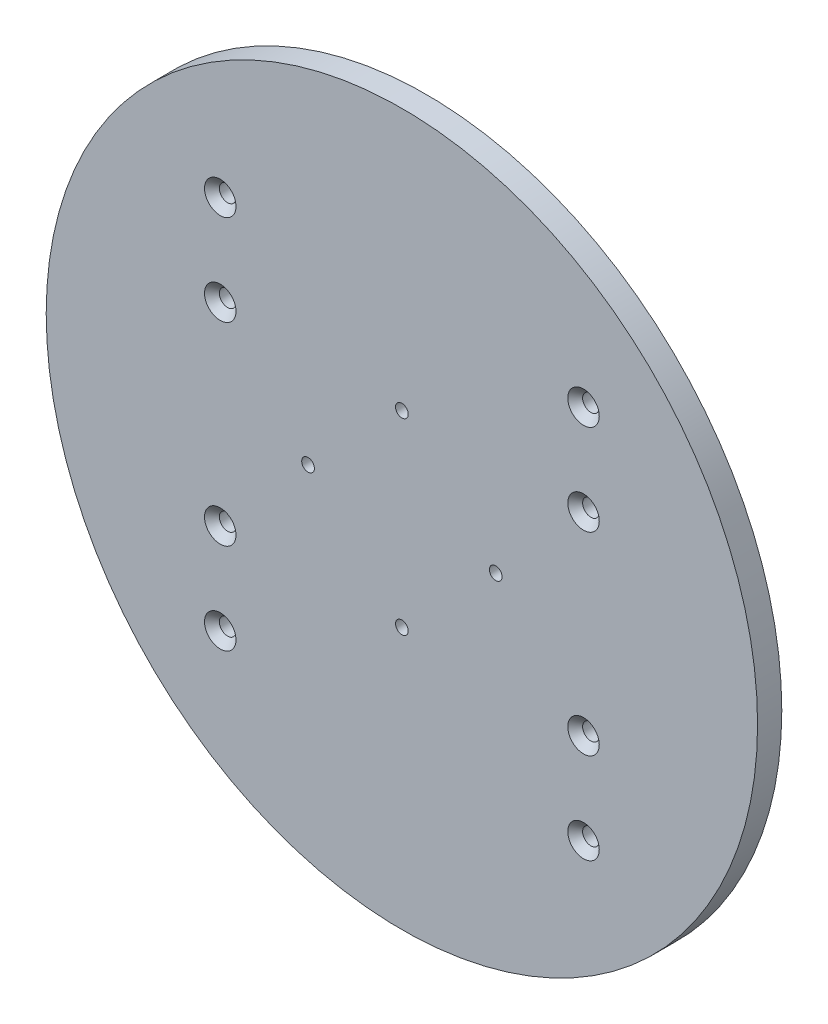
ISO-10303-21;
HEADER;
FILE_DESCRIPTION(('STEP AP214'),'2;1');
FILE_NAME('part.step','',(''),(''),'','','');
FILE_SCHEMA(('AUTOMOTIVE_DESIGN { 1 0 10303 214 1 1 1 1 }'));
ENDSEC;
DATA;
#1=APPLICATION_CONTEXT('core data for automotive mechanical design processes');
#2=APPLICATION_PROTOCOL_DEFINITION('international standard','automotive_design',2000,#1);
#3=PRODUCT_CONTEXT('',#1,'mechanical');
#4=PRODUCT('Part','Part','',(#3));
#5=PRODUCT_RELATED_PRODUCT_CATEGORY('part','',(#4));
#6=PRODUCT_DEFINITION_FORMATION('','',#4);
#7=PRODUCT_DEFINITION_CONTEXT('part definition',#1,'design');
#8=PRODUCT_DEFINITION('design','',#6,#7);
#9=PRODUCT_DEFINITION_SHAPE('','',#8);
#10=(LENGTH_UNIT() NAMED_UNIT(*) SI_UNIT(.MILLI.,.METRE.));
#11=(NAMED_UNIT(*) PLANE_ANGLE_UNIT() SI_UNIT($,.RADIAN.));
#12=(NAMED_UNIT(*) SI_UNIT($,.STERADIAN.) SOLID_ANGLE_UNIT());
#13=UNCERTAINTY_MEASURE_WITH_UNIT(LENGTH_MEASURE(1.E-05),#10,'distance_accuracy_value','');
#14=(GEOMETRIC_REPRESENTATION_CONTEXT(3) GLOBAL_UNCERTAINTY_ASSIGNED_CONTEXT((#13)) GLOBAL_UNIT_ASSIGNED_CONTEXT((#10,
#11,#12)) REPRESENTATION_CONTEXT('',''));
#15=CARTESIAN_POINT('',(0.,0.,0.));
#16=DIRECTION('',(0.,0.,1.));
#17=DIRECTION('',(1.,0.,0.));
#18=AXIS2_PLACEMENT_3D('',#15,#16,#17);
#19=CARTESIAN_POINT('',(0.,0.,8.));
#20=DIRECTION('',(0.,0.,-1.));
#21=DIRECTION('',(-1.,0.,0.));
#22=AXIS2_PLACEMENT_3D('',#19,#20,#21);
#23=CYLINDRICAL_SURFACE('',#22,117.5);
#24=CARTESIAN_POINT('',(0.,0.,8.));
#25=DIRECTION('',(0.,0.,1.));
#26=DIRECTION('',(1.,0.,0.));
#27=AXIS2_PLACEMENT_3D('',#24,#25,#26);
#28=CIRCLE('',#27,117.5);
#29=CARTESIAN_POINT('',(117.5,0.,8.));
#30=VERTEX_POINT('',#29);
#31=EDGE_CURVE('E10',#30,#30,#28,.T.);
#32=ORIENTED_EDGE('',*,*,#31,.F.);
#33=EDGE_LOOP('',(#32));
#34=FACE_BOUND('',#33,.T.);
#35=CARTESIAN_POINT('',(0.,0.,0.));
#36=DIRECTION('',(0.,0.,1.));
#37=DIRECTION('',(1.,0.,0.));
#38=AXIS2_PLACEMENT_3D('',#35,#36,#37);
#39=CIRCLE('',#38,117.5);
#40=CARTESIAN_POINT('',(117.5,0.,0.));
#41=VERTEX_POINT('',#40);
#42=EDGE_CURVE('E39',#41,#41,#39,.T.);
#43=ORIENTED_EDGE('',*,*,#42,.T.);
#44=EDGE_LOOP('',(#43));
#45=FACE_BOUND('',#44,.T.);
#46=ADVANCED_FACE('F36',(#34,#45),#23,.T.);
#47=CARTESIAN_POINT('',(0.,0.,8.));
#48=DIRECTION('',(0.,0.,1.));
#49=DIRECTION('',(1.,0.,0.));
#50=AXIS2_PLACEMENT_3D('',#47,#48,#49);
#51=PLANE('',#50);
#52=CARTESIAN_POINT('',(0.,31.,8.));
#53=DIRECTION('',(0.,0.,1.));
#54=DIRECTION('',(1.,0.,0.));
#55=AXIS2_PLACEMENT_3D('',#52,#53,#54);
#56=CIRCLE('',#55,2.09999999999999);
#57=CARTESIAN_POINT('',(2.09999999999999,31.,8.));
#58=VERTEX_POINT('',#57);
#59=EDGE_CURVE('E144',#58,#58,#56,.T.);
#60=ORIENTED_EDGE('',*,*,#59,.F.);
#61=EDGE_LOOP('',(#60));
#62=FACE_BOUND('',#61,.T.);
#63=CARTESIAN_POINT('',(31.000000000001,1.01846664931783E-12,8.));
#64=DIRECTION('',(0.,0.,1.));
#65=DIRECTION('',(1.,0.,0.));
#66=AXIS2_PLACEMENT_3D('',#63,#64,#65);
#67=CIRCLE('',#66,2.09999999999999);
#68=CARTESIAN_POINT('',(33.100000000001,1.01846664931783E-12,8.));
#69=VERTEX_POINT('',#68);
#70=EDGE_CURVE('E138',#69,#69,#67,.T.);
#71=ORIENTED_EDGE('',*,*,#70,.F.);
#72=EDGE_LOOP('',(#71));
#73=FACE_BOUND('',#72,.T.);
#74=CARTESIAN_POINT('',(2.03693329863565E-12,-31.,8.));
#75=DIRECTION('',(0.,0.,1.));
#76=DIRECTION('',(1.,0.,0.));
#77=AXIS2_PLACEMENT_3D('',#74,#75,#76);
#78=CIRCLE('',#77,2.09999999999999);
#79=CARTESIAN_POINT('',(2.10000000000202,-31.,8.));
#80=VERTEX_POINT('',#79);
#81=EDGE_CURVE('E132',#80,#80,#78,.T.);
#82=ORIENTED_EDGE('',*,*,#81,.F.);
#83=EDGE_LOOP('',(#82));
#84=FACE_BOUND('',#83,.T.);
#85=CARTESIAN_POINT('',(-30.999999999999,-1.01467024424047E-12,8.));
#86=DIRECTION('',(0.,0.,1.));
#87=DIRECTION('',(1.,0.,0.));
#88=AXIS2_PLACEMENT_3D('',#85,#86,#87);
#89=CIRCLE('',#88,2.09999999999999);
#90=CARTESIAN_POINT('',(-28.899999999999,-1.01467024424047E-12,8.));
#91=VERTEX_POINT('',#90);
#92=EDGE_CURVE('E126',#91,#91,#89,.T.);
#93=ORIENTED_EDGE('',*,*,#92,.F.);
#94=EDGE_LOOP('',(#93));
#95=FACE_BOUND('',#94,.T.);
#96=CARTESIAN_POINT('',(-60.,-32.,8.));
#97=DIRECTION('',(0.,0.,1.));
#98=DIRECTION('',(1.,0.,0.));
#99=AXIS2_PLACEMENT_3D('',#96,#97,#98);
#100=CIRCLE('',#99,5.2);
#101=CARTESIAN_POINT('',(-54.8,-32.,8.));
#102=VERTEX_POINT('',#101);
#103=EDGE_CURVE('E120',#102,#102,#100,.T.);
#104=ORIENTED_EDGE('',*,*,#103,.F.);
#105=EDGE_LOOP('',(#104));
#106=FACE_BOUND('',#105,.T.);
#107=CARTESIAN_POINT('',(60.,32.,8.));
#108=DIRECTION('',(0.,0.,1.));
#109=DIRECTION('',(1.,0.,0.));
#110=AXIS2_PLACEMENT_3D('',#107,#108,#109);
#111=CIRCLE('',#110,5.2);
#112=CARTESIAN_POINT('',(65.2,32.,8.));
#113=VERTEX_POINT('',#112);
#114=EDGE_CURVE('E111',#113,#113,#111,.T.);
#115=ORIENTED_EDGE('',*,*,#114,.F.);
#116=EDGE_LOOP('',(#115));
#117=FACE_BOUND('',#116,.T.);
#118=CARTESIAN_POINT('',(-60.,32.,8.));
#119=DIRECTION('',(0.,0.,1.));
#120=DIRECTION('',(1.,0.,0.));
#121=AXIS2_PLACEMENT_3D('',#118,#119,#120);
#122=CIRCLE('',#121,5.2);
#123=CARTESIAN_POINT('',(-54.8,32.,8.));
#124=VERTEX_POINT('',#123);
#125=EDGE_CURVE('E101',#124,#124,#122,.T.);
#126=ORIENTED_EDGE('',*,*,#125,.F.);
#127=EDGE_LOOP('',(#126));
#128=FACE_BOUND('',#127,.T.);
#129=CARTESIAN_POINT('',(60.,-32.,8.));
#130=DIRECTION('',(0.,0.,1.));
#131=DIRECTION('',(1.,0.,0.));
#132=AXIS2_PLACEMENT_3D('',#129,#130,#131);
#133=CIRCLE('',#132,5.2);
#134=CARTESIAN_POINT('',(65.2,-32.,8.));
#135=VERTEX_POINT('',#134);
#136=EDGE_CURVE('E92',#135,#135,#133,.T.);
#137=ORIENTED_EDGE('',*,*,#136,.F.);
#138=EDGE_LOOP('',(#137));
#139=FACE_BOUND('',#138,.T.);
#140=CARTESIAN_POINT('',(-60.,62.,8.));
#141=DIRECTION('',(0.,0.,1.));
#142=DIRECTION('',(1.,0.,0.));
#143=AXIS2_PLACEMENT_3D('',#140,#141,#142);
#144=CIRCLE('',#143,5.2);
#145=CARTESIAN_POINT('',(-54.8,62.,8.));
#146=VERTEX_POINT('',#145);
#147=EDGE_CURVE('E83',#146,#146,#144,.T.);
#148=ORIENTED_EDGE('',*,*,#147,.F.);
#149=EDGE_LOOP('',(#148));
#150=FACE_BOUND('',#149,.T.);
#151=CARTESIAN_POINT('',(60.,62.,8.));
#152=DIRECTION('',(0.,0.,1.));
#153=DIRECTION('',(1.,0.,0.));
#154=AXIS2_PLACEMENT_3D('',#151,#152,#153);
#155=CIRCLE('',#154,5.2);
#156=CARTESIAN_POINT('',(65.2,62.,8.));
#157=VERTEX_POINT('',#156);
#158=EDGE_CURVE('E74',#157,#157,#155,.T.);
#159=ORIENTED_EDGE('',*,*,#158,.F.);
#160=EDGE_LOOP('',(#159));
#161=FACE_BOUND('',#160,.T.);
#162=CARTESIAN_POINT('',(60.,-62.,8.));
#163=DIRECTION('',(0.,0.,1.));
#164=DIRECTION('',(1.,0.,0.));
#165=AXIS2_PLACEMENT_3D('',#162,#163,#164);
#166=CIRCLE('',#165,5.2);
#167=CARTESIAN_POINT('',(65.2,-62.,8.));
#168=VERTEX_POINT('',#167);
#169=EDGE_CURVE('E65',#168,#168,#166,.T.);
#170=ORIENTED_EDGE('',*,*,#169,.F.);
#171=EDGE_LOOP('',(#170));
#172=FACE_BOUND('',#171,.T.);
#173=CARTESIAN_POINT('',(-60.,-62.,8.));
#174=DIRECTION('',(0.,0.,1.));
#175=DIRECTION('',(1.,0.,0.));
#176=AXIS2_PLACEMENT_3D('',#173,#174,#175);
#177=CIRCLE('',#176,5.2);
#178=CARTESIAN_POINT('',(-54.8,-62.,8.));
#179=VERTEX_POINT('',#178);
#180=EDGE_CURVE('E56',#179,#179,#177,.T.);
#181=ORIENTED_EDGE('',*,*,#180,.F.);
#182=EDGE_LOOP('',(#181));
#183=FACE_BOUND('',#182,.T.);
#184=ORIENTED_EDGE('',*,*,#31,.T.);
#185=EDGE_LOOP('',(#184));
#186=FACE_BOUND('',#185,.T.);
#187=ADVANCED_FACE('F150',(#62,#73,#84,#95,#106,#117,#128,#139,#150,#161,#172,#183,#186),#51,.T.);
#188=CARTESIAN_POINT('',(0.,0.,0.));
#189=DIRECTION('',(0.,0.,1.));
#190=DIRECTION('',(1.,0.,0.));
#191=AXIS2_PLACEMENT_3D('',#188,#189,#190);
#192=PLANE('',#191);
#193=CARTESIAN_POINT('',(0.,31.,0.));
#194=DIRECTION('',(0.,0.,1.));
#195=DIRECTION('',(1.,0.,0.));
#196=AXIS2_PLACEMENT_3D('',#193,#194,#195);
#197=CIRCLE('',#196,2.1);
#198=CARTESIAN_POINT('',(2.1,31.,0.));
#199=VERTEX_POINT('',#198);
#200=EDGE_CURVE('E141',#199,#199,#197,.T.);
#201=ORIENTED_EDGE('',*,*,#200,.T.);
#202=EDGE_LOOP('',(#201));
#203=FACE_BOUND('',#202,.T.);
#204=CARTESIAN_POINT('',(31.000000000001,1.01846664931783E-12,0.));
#205=DIRECTION('',(0.,0.,1.));
#206=DIRECTION('',(1.,0.,0.));
#207=AXIS2_PLACEMENT_3D('',#204,#205,#206);
#208=CIRCLE('',#207,2.1);
#209=CARTESIAN_POINT('',(33.100000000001,1.01846664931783E-12,0.));
#210=VERTEX_POINT('',#209);
#211=EDGE_CURVE('E135',#210,#210,#208,.T.);
#212=ORIENTED_EDGE('',*,*,#211,.T.);
#213=EDGE_LOOP('',(#212));
#214=FACE_BOUND('',#213,.T.);
#215=CARTESIAN_POINT('',(2.03693329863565E-12,-31.,0.));
#216=DIRECTION('',(0.,0.,1.));
#217=DIRECTION('',(1.,0.,0.));
#218=AXIS2_PLACEMENT_3D('',#215,#216,#217);
#219=CIRCLE('',#218,2.1);
#220=CARTESIAN_POINT('',(2.10000000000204,-31.,0.));
#221=VERTEX_POINT('',#220);
#222=EDGE_CURVE('E129',#221,#221,#219,.T.);
#223=ORIENTED_EDGE('',*,*,#222,.T.);
#224=EDGE_LOOP('',(#223));
#225=FACE_BOUND('',#224,.T.);
#226=CARTESIAN_POINT('',(-30.999999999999,-1.01467024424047E-12,0.));
#227=DIRECTION('',(0.,0.,1.));
#228=DIRECTION('',(1.,0.,0.));
#229=AXIS2_PLACEMENT_3D('',#226,#227,#228);
#230=CIRCLE('',#229,2.1);
#231=CARTESIAN_POINT('',(-28.899999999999,-1.01467024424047E-12,0.));
#232=VERTEX_POINT('',#231);
#233=EDGE_CURVE('E123',#232,#232,#230,.T.);
#234=ORIENTED_EDGE('',*,*,#233,.T.);
#235=EDGE_LOOP('',(#234));
#236=FACE_BOUND('',#235,.T.);
#237=CARTESIAN_POINT('',(-60.,-32.,0.));
#238=DIRECTION('',(0.,0.,1.));
#239=DIRECTION('',(1.,0.,0.));
#240=AXIS2_PLACEMENT_3D('',#237,#238,#239);
#241=CIRCLE('',#240,2.75);
#242=CARTESIAN_POINT('',(-57.25,-32.,0.));
#243=VERTEX_POINT('',#242);
#244=EDGE_CURVE('E114',#243,#243,#241,.T.);
#245=ORIENTED_EDGE('',*,*,#244,.T.);
#246=EDGE_LOOP('',(#245));
#247=FACE_BOUND('',#246,.T.);
#248=CARTESIAN_POINT('',(60.,32.,0.));
#249=DIRECTION('',(0.,0.,1.));
#250=DIRECTION('',(1.,0.,0.));
#251=AXIS2_PLACEMENT_3D('',#248,#249,#250);
#252=CIRCLE('',#251,2.75);
#253=CARTESIAN_POINT('',(62.75,32.,0.));
#254=VERTEX_POINT('',#253);
#255=EDGE_CURVE('E105',#254,#254,#252,.T.);
#256=ORIENTED_EDGE('',*,*,#255,.T.);
#257=EDGE_LOOP('',(#256));
#258=FACE_BOUND('',#257,.T.);
#259=CARTESIAN_POINT('',(-60.,32.,0.));
#260=DIRECTION('',(0.,0.,1.));
#261=DIRECTION('',(1.,0.,0.));
#262=AXIS2_PLACEMENT_3D('',#259,#260,#261);
#263=CIRCLE('',#262,2.75);
#264=CARTESIAN_POINT('',(-57.25,32.,0.));
#265=VERTEX_POINT('',#264);
#266=EDGE_CURVE('E95',#265,#265,#263,.T.);
#267=ORIENTED_EDGE('',*,*,#266,.T.);
#268=EDGE_LOOP('',(#267));
#269=FACE_BOUND('',#268,.T.);
#270=CARTESIAN_POINT('',(60.,-32.,0.));
#271=DIRECTION('',(0.,0.,1.));
#272=DIRECTION('',(1.,0.,0.));
#273=AXIS2_PLACEMENT_3D('',#270,#271,#272);
#274=CIRCLE('',#273,2.75);
#275=CARTESIAN_POINT('',(62.75,-32.,0.));
#276=VERTEX_POINT('',#275);
#277=EDGE_CURVE('E86',#276,#276,#274,.T.);
#278=ORIENTED_EDGE('',*,*,#277,.T.);
#279=EDGE_LOOP('',(#278));
#280=FACE_BOUND('',#279,.T.);
#281=CARTESIAN_POINT('',(-60.,62.,0.));
#282=DIRECTION('',(0.,0.,1.));
#283=DIRECTION('',(1.,0.,0.));
#284=AXIS2_PLACEMENT_3D('',#281,#282,#283);
#285=CIRCLE('',#284,2.75);
#286=CARTESIAN_POINT('',(-57.25,62.,0.));
#287=VERTEX_POINT('',#286);
#288=EDGE_CURVE('E77',#287,#287,#285,.T.);
#289=ORIENTED_EDGE('',*,*,#288,.T.);
#290=EDGE_LOOP('',(#289));
#291=FACE_BOUND('',#290,.T.);
#292=CARTESIAN_POINT('',(60.,62.,0.));
#293=DIRECTION('',(0.,0.,1.));
#294=DIRECTION('',(1.,0.,0.));
#295=AXIS2_PLACEMENT_3D('',#292,#293,#294);
#296=CIRCLE('',#295,2.75);
#297=CARTESIAN_POINT('',(62.75,62.,0.));
#298=VERTEX_POINT('',#297);
#299=EDGE_CURVE('E68',#298,#298,#296,.T.);
#300=ORIENTED_EDGE('',*,*,#299,.T.);
#301=EDGE_LOOP('',(#300));
#302=FACE_BOUND('',#301,.T.);
#303=CARTESIAN_POINT('',(60.,-62.,0.));
#304=DIRECTION('',(0.,0.,1.));
#305=DIRECTION('',(1.,0.,0.));
#306=AXIS2_PLACEMENT_3D('',#303,#304,#305);
#307=CIRCLE('',#306,2.75);
#308=CARTESIAN_POINT('',(62.75,-62.,0.));
#309=VERTEX_POINT('',#308);
#310=EDGE_CURVE('E59',#309,#309,#307,.T.);
#311=ORIENTED_EDGE('',*,*,#310,.T.);
#312=EDGE_LOOP('',(#311));
#313=FACE_BOUND('',#312,.T.);
#314=CARTESIAN_POINT('',(-60.,-62.,0.));
#315=DIRECTION('',(0.,0.,1.));
#316=DIRECTION('',(1.,0.,0.));
#317=AXIS2_PLACEMENT_3D('',#314,#315,#316);
#318=CIRCLE('',#317,2.75);
#319=CARTESIAN_POINT('',(-57.25,-62.,0.));
#320=VERTEX_POINT('',#319);
#321=EDGE_CURVE('E49',#320,#320,#318,.T.);
#322=ORIENTED_EDGE('',*,*,#321,.T.);
#323=EDGE_LOOP('',(#322));
#324=FACE_BOUND('',#323,.T.);
#325=ORIENTED_EDGE('',*,*,#42,.F.);
#326=EDGE_LOOP('',(#325));
#327=FACE_BOUND('',#326,.T.);
#328=ADVANCED_FACE('F153',(#203,#214,#225,#236,#247,#258,#269,#280,#291,#302,#313,#324,#327),
#192,.F.);
#329=CARTESIAN_POINT('',(-60.,-62.,8.));
#330=DIRECTION('',(0.,0.,1.));
#331=DIRECTION('',(1.,0.,0.));
#332=AXIS2_PLACEMENT_3D('',#329,#330,#331);
#333=CYLINDRICAL_SURFACE('',#332,2.75);
#334=ORIENTED_EDGE('',*,*,#321,.F.);
#335=EDGE_LOOP('',(#334));
#336=FACE_BOUND('',#335,.T.);
#337=CARTESIAN_POINT('',(-60.,-62.,5.55));
#338=DIRECTION('',(0.,0.,1.));
#339=DIRECTION('',(1.,0.,0.));
#340=AXIS2_PLACEMENT_3D('',#337,#338,#339);
#341=CIRCLE('',#340,2.75);
#342=CARTESIAN_POINT('',(-57.25,-62.,5.55));
#343=VERTEX_POINT('',#342);
#344=EDGE_CURVE('E53',#343,#343,#341,.T.);
#345=ORIENTED_EDGE('',*,*,#344,.T.);
#346=EDGE_LOOP('',(#345));
#347=FACE_BOUND('',#346,.T.);
#348=ADVANCED_FACE('F180',(#336,#347),#333,.F.);
#349=CARTESIAN_POINT('',(-60.,-62.,8.));
#350=DIRECTION('',(0.,0.,1.));
#351=DIRECTION('',(1.,0.,0.));
#352=AXIS2_PLACEMENT_3D('',#349,#350,#351);
#353=CONICAL_SURFACE('',#352,5.2,0.785398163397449);
#354=ORIENTED_EDGE('',*,*,#344,.F.);
#355=EDGE_LOOP('',(#354));
#356=FACE_BOUND('',#355,.T.);
#357=ORIENTED_EDGE('',*,*,#180,.T.);
#358=EDGE_LOOP('',(#357));
#359=FACE_BOUND('',#358,.T.);
#360=ADVANCED_FACE('F177',(#356,#359),#353,.F.);
#361=CARTESIAN_POINT('',(60.,-62.,8.));
#362=DIRECTION('',(0.,0.,1.));
#363=DIRECTION('',(1.,0.,0.));
#364=AXIS2_PLACEMENT_3D('',#361,#362,#363);
#365=CYLINDRICAL_SURFACE('',#364,2.75);
#366=ORIENTED_EDGE('',*,*,#310,.F.);
#367=EDGE_LOOP('',(#366));
#368=FACE_BOUND('',#367,.T.);
#369=CARTESIAN_POINT('',(60.,-62.,5.55));
#370=DIRECTION('',(0.,0.,1.));
#371=DIRECTION('',(1.,0.,0.));
#372=AXIS2_PLACEMENT_3D('',#369,#370,#371);
#373=CIRCLE('',#372,2.75);
#374=CARTESIAN_POINT('',(62.75,-62.,5.55));
#375=VERTEX_POINT('',#374);
#376=EDGE_CURVE('E62',#375,#375,#373,.T.);
#377=ORIENTED_EDGE('',*,*,#376,.T.);
#378=EDGE_LOOP('',(#377));
#379=FACE_BOUND('',#378,.T.);
#380=ADVANCED_FACE('F179',(#368,#379),#365,.F.);
#381=CARTESIAN_POINT('',(60.,-62.,8.));
#382=DIRECTION('',(0.,0.,1.));
#383=DIRECTION('',(1.,0.,0.));
#384=AXIS2_PLACEMENT_3D('',#381,#382,#383);
#385=CONICAL_SURFACE('',#384,5.2,0.785398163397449);
#386=ORIENTED_EDGE('',*,*,#376,.F.);
#387=EDGE_LOOP('',(#386));
#388=FACE_BOUND('',#387,.T.);
#389=ORIENTED_EDGE('',*,*,#169,.T.);
#390=EDGE_LOOP('',(#389));
#391=FACE_BOUND('',#390,.T.);
#392=ADVANCED_FACE('F187',(#388,#391),#385,.F.);
#393=CARTESIAN_POINT('',(60.,62.,8.));
#394=DIRECTION('',(0.,0.,1.));
#395=DIRECTION('',(1.,0.,0.));
#396=AXIS2_PLACEMENT_3D('',#393,#394,#395);
#397=CYLINDRICAL_SURFACE('',#396,2.75);
#398=ORIENTED_EDGE('',*,*,#299,.F.);
#399=EDGE_LOOP('',(#398));
#400=FACE_BOUND('',#399,.T.);
#401=CARTESIAN_POINT('',(60.,62.,5.55));
#402=DIRECTION('',(0.,0.,1.));
#403=DIRECTION('',(1.,0.,0.));
#404=AXIS2_PLACEMENT_3D('',#401,#402,#403);
#405=CIRCLE('',#404,2.75);
#406=CARTESIAN_POINT('',(62.75,62.,5.55));
#407=VERTEX_POINT('',#406);
#408=EDGE_CURVE('E71',#407,#407,#405,.T.);
#409=ORIENTED_EDGE('',*,*,#408,.T.);
#410=EDGE_LOOP('',(#409));
#411=FACE_BOUND('',#410,.T.);
#412=ADVANCED_FACE('F233',(#400,#411),#397,.F.);
#413=CARTESIAN_POINT('',(60.,62.,8.));
#414=DIRECTION('',(0.,0.,1.));
#415=DIRECTION('',(1.,0.,0.));
#416=AXIS2_PLACEMENT_3D('',#413,#414,#415);
#417=CONICAL_SURFACE('',#416,5.2,0.785398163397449);
#418=ORIENTED_EDGE('',*,*,#408,.F.);
#419=EDGE_LOOP('',(#418));
#420=FACE_BOUND('',#419,.T.);
#421=ORIENTED_EDGE('',*,*,#158,.T.);
#422=EDGE_LOOP('',(#421));
#423=FACE_BOUND('',#422,.T.);
#424=ADVANCED_FACE('F238',(#420,#423),#417,.F.);
#425=CARTESIAN_POINT('',(-60.,62.,8.));
#426=DIRECTION('',(0.,0.,1.));
#427=DIRECTION('',(1.,0.,0.));
#428=AXIS2_PLACEMENT_3D('',#425,#426,#427);
#429=CYLINDRICAL_SURFACE('',#428,2.75);
#430=ORIENTED_EDGE('',*,*,#288,.F.);
#431=EDGE_LOOP('',(#430));
#432=FACE_BOUND('',#431,.T.);
#433=CARTESIAN_POINT('',(-60.,62.,5.55));
#434=DIRECTION('',(0.,0.,1.));
#435=DIRECTION('',(1.,0.,0.));
#436=AXIS2_PLACEMENT_3D('',#433,#434,#435);
#437=CIRCLE('',#436,2.75);
#438=CARTESIAN_POINT('',(-57.25,62.,5.55));
#439=VERTEX_POINT('',#438);
#440=EDGE_CURVE('E80',#439,#439,#437,.T.);
#441=ORIENTED_EDGE('',*,*,#440,.T.);
#442=EDGE_LOOP('',(#441));
#443=FACE_BOUND('',#442,.T.);
#444=ADVANCED_FACE('F244',(#432,#443),#429,.F.);
#445=CARTESIAN_POINT('',(-60.,62.,8.));
#446=DIRECTION('',(0.,0.,1.));
#447=DIRECTION('',(1.,0.,0.));
#448=AXIS2_PLACEMENT_3D('',#445,#446,#447);
#449=CONICAL_SURFACE('',#448,5.2,0.785398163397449);
#450=ORIENTED_EDGE('',*,*,#440,.F.);
#451=EDGE_LOOP('',(#450));
#452=FACE_BOUND('',#451,.T.);
#453=ORIENTED_EDGE('',*,*,#147,.T.);
#454=EDGE_LOOP('',(#453));
#455=FACE_BOUND('',#454,.T.);
#456=ADVANCED_FACE('F248',(#452,#455),#449,.F.);
#457=CARTESIAN_POINT('',(60.,-32.,8.));
#458=DIRECTION('',(0.,0.,1.));
#459=DIRECTION('',(1.,0.,0.));
#460=AXIS2_PLACEMENT_3D('',#457,#458,#459);
#461=CYLINDRICAL_SURFACE('',#460,2.75);
#462=ORIENTED_EDGE('',*,*,#277,.F.);
#463=EDGE_LOOP('',(#462));
#464=FACE_BOUND('',#463,.T.);
#465=CARTESIAN_POINT('',(60.,-32.,5.55));
#466=DIRECTION('',(0.,0.,1.));
#467=DIRECTION('',(1.,0.,0.));
#468=AXIS2_PLACEMENT_3D('',#465,#466,#467);
#469=CIRCLE('',#468,2.75);
#470=CARTESIAN_POINT('',(62.75,-32.,5.55));
#471=VERTEX_POINT('',#470);
#472=EDGE_CURVE('E89',#471,#471,#469,.T.);
#473=ORIENTED_EDGE('',*,*,#472,.T.);
#474=EDGE_LOOP('',(#473));
#475=FACE_BOUND('',#474,.T.);
#476=ADVANCED_FACE('F252',(#464,#475),#461,.F.);
#477=CARTESIAN_POINT('',(60.,-32.,8.));
#478=DIRECTION('',(0.,0.,1.));
#479=DIRECTION('',(1.,0.,0.));
#480=AXIS2_PLACEMENT_3D('',#477,#478,#479);
#481=CONICAL_SURFACE('',#480,5.2,0.785398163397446);
#482=ORIENTED_EDGE('',*,*,#472,.F.);
#483=EDGE_LOOP('',(#482));
#484=FACE_BOUND('',#483,.T.);
#485=ORIENTED_EDGE('',*,*,#136,.T.);
#486=EDGE_LOOP('',(#485));
#487=FACE_BOUND('',#486,.T.);
#488=ADVANCED_FACE('F256',(#484,#487),#481,.F.);
#489=CARTESIAN_POINT('',(-60.,32.,8.));
#490=DIRECTION('',(0.,0.,1.));
#491=DIRECTION('',(1.,0.,0.));
#492=AXIS2_PLACEMENT_3D('',#489,#490,#491);
#493=CYLINDRICAL_SURFACE('',#492,2.75);
#494=ORIENTED_EDGE('',*,*,#266,.F.);
#495=EDGE_LOOP('',(#494));
#496=FACE_BOUND('',#495,.T.);
#497=CARTESIAN_POINT('',(-60.,32.,5.55));
#498=DIRECTION('',(0.,0.,1.));
#499=DIRECTION('',(1.,0.,0.));
#500=AXIS2_PLACEMENT_3D('',#497,#498,#499);
#501=CIRCLE('',#500,2.75);
#502=CARTESIAN_POINT('',(-57.25,32.,5.55));
#503=VERTEX_POINT('',#502);
#504=EDGE_CURVE('E98',#503,#503,#501,.T.);
#505=ORIENTED_EDGE('',*,*,#504,.T.);
#506=EDGE_LOOP('',(#505));
#507=FACE_BOUND('',#506,.T.);
#508=ADVANCED_FACE('F260',(#496,#507),#493,.F.);
#509=CARTESIAN_POINT('',(-60.,32.,8.));
#510=DIRECTION('',(0.,0.,1.));
#511=DIRECTION('',(1.,0.,0.));
#512=AXIS2_PLACEMENT_3D('',#509,#510,#511);
#513=CONICAL_SURFACE('',#512,5.2,0.785398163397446);
#514=ORIENTED_EDGE('',*,*,#504,.F.);
#515=EDGE_LOOP('',(#514));
#516=FACE_BOUND('',#515,.T.);
#517=ORIENTED_EDGE('',*,*,#125,.T.);
#518=EDGE_LOOP('',(#517));
#519=FACE_BOUND('',#518,.T.);
#520=ADVANCED_FACE('F264',(#516,#519),#513,.F.);
#521=CARTESIAN_POINT('',(60.,32.,8.));
#522=DIRECTION('',(0.,0.,1.));
#523=DIRECTION('',(1.,0.,0.));
#524=AXIS2_PLACEMENT_3D('',#521,#522,#523);
#525=CYLINDRICAL_SURFACE('',#524,2.75);
#526=ORIENTED_EDGE('',*,*,#255,.F.);
#527=EDGE_LOOP('',(#526));
#528=FACE_BOUND('',#527,.T.);
#529=CARTESIAN_POINT('',(60.,32.,5.55));
#530=DIRECTION('',(0.,0.,1.));
#531=DIRECTION('',(1.,0.,0.));
#532=AXIS2_PLACEMENT_3D('',#529,#530,#531);
#533=CIRCLE('',#532,2.75);
#534=CARTESIAN_POINT('',(62.75,32.,5.55));
#535=VERTEX_POINT('',#534);
#536=EDGE_CURVE('E108',#535,#535,#533,.T.);
#537=ORIENTED_EDGE('',*,*,#536,.T.);
#538=EDGE_LOOP('',(#537));
#539=FACE_BOUND('',#538,.T.);
#540=ADVANCED_FACE('F268',(#528,#539),#525,.F.);
#541=CARTESIAN_POINT('',(60.,32.,8.));
#542=DIRECTION('',(0.,0.,1.));
#543=DIRECTION('',(1.,0.,0.));
#544=AXIS2_PLACEMENT_3D('',#541,#542,#543);
#545=CONICAL_SURFACE('',#544,5.2,0.785398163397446);
#546=ORIENTED_EDGE('',*,*,#536,.F.);
#547=EDGE_LOOP('',(#546));
#548=FACE_BOUND('',#547,.T.);
#549=ORIENTED_EDGE('',*,*,#114,.T.);
#550=EDGE_LOOP('',(#549));
#551=FACE_BOUND('',#550,.T.);
#552=ADVANCED_FACE('F272',(#548,#551),#545,.F.);
#553=CARTESIAN_POINT('',(-60.,-32.,8.));
#554=DIRECTION('',(0.,0.,1.));
#555=DIRECTION('',(1.,0.,0.));
#556=AXIS2_PLACEMENT_3D('',#553,#554,#555);
#557=CYLINDRICAL_SURFACE('',#556,2.75);
#558=ORIENTED_EDGE('',*,*,#244,.F.);
#559=EDGE_LOOP('',(#558));
#560=FACE_BOUND('',#559,.T.);
#561=CARTESIAN_POINT('',(-60.,-32.,5.55));
#562=DIRECTION('',(0.,0.,1.));
#563=DIRECTION('',(1.,0.,0.));
#564=AXIS2_PLACEMENT_3D('',#561,#562,#563);
#565=CIRCLE('',#564,2.75);
#566=CARTESIAN_POINT('',(-57.25,-32.,5.55));
#567=VERTEX_POINT('',#566);
#568=EDGE_CURVE('E117',#567,#567,#565,.T.);
#569=ORIENTED_EDGE('',*,*,#568,.T.);
#570=EDGE_LOOP('',(#569));
#571=FACE_BOUND('',#570,.T.);
#572=ADVANCED_FACE('F276',(#560,#571),#557,.F.);
#573=CARTESIAN_POINT('',(-60.,-32.,8.));
#574=DIRECTION('',(0.,0.,1.));
#575=DIRECTION('',(1.,0.,0.));
#576=AXIS2_PLACEMENT_3D('',#573,#574,#575);
#577=CONICAL_SURFACE('',#576,5.2,0.785398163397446);
#578=ORIENTED_EDGE('',*,*,#568,.F.);
#579=EDGE_LOOP('',(#578));
#580=FACE_BOUND('',#579,.T.);
#581=ORIENTED_EDGE('',*,*,#103,.T.);
#582=EDGE_LOOP('',(#581));
#583=FACE_BOUND('',#582,.T.);
#584=ADVANCED_FACE('F280',(#580,#583),#577,.F.);
#585=CARTESIAN_POINT('',(-30.999999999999,-1.01467024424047E-12,8.));
#586=DIRECTION('',(0.,0.,1.));
#587=DIRECTION('',(1.,0.,0.));
#588=AXIS2_PLACEMENT_3D('',#585,#586,#587);
#589=CYLINDRICAL_SURFACE('',#588,2.09999999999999);
#590=ORIENTED_EDGE('',*,*,#233,.F.);
#591=EDGE_LOOP('',(#590));
#592=FACE_BOUND('',#591,.T.);
#593=ORIENTED_EDGE('',*,*,#92,.T.);
#594=EDGE_LOOP('',(#593));
#595=FACE_BOUND('',#594,.T.);
#596=ADVANCED_FACE('F284',(#592,#595),#589,.F.);
#597=CARTESIAN_POINT('',(2.03693329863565E-12,-31.,8.));
#598=DIRECTION('',(0.,0.,1.));
#599=DIRECTION('',(1.,0.,0.));
#600=AXIS2_PLACEMENT_3D('',#597,#598,#599);
#601=CYLINDRICAL_SURFACE('',#600,2.09999999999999);
#602=ORIENTED_EDGE('',*,*,#222,.F.);
#603=EDGE_LOOP('',(#602));
#604=FACE_BOUND('',#603,.T.);
#605=ORIENTED_EDGE('',*,*,#81,.T.);
#606=EDGE_LOOP('',(#605));
#607=FACE_BOUND('',#606,.T.);
#608=ADVANCED_FACE('F288',(#604,#607),#601,.F.);
#609=CARTESIAN_POINT('',(31.000000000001,1.01846664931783E-12,8.));
#610=DIRECTION('',(0.,0.,1.));
#611=DIRECTION('',(1.,0.,0.));
#612=AXIS2_PLACEMENT_3D('',#609,#610,#611);
#613=CYLINDRICAL_SURFACE('',#612,2.09999999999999);
#614=ORIENTED_EDGE('',*,*,#211,.F.);
#615=EDGE_LOOP('',(#614));
#616=FACE_BOUND('',#615,.T.);
#617=ORIENTED_EDGE('',*,*,#70,.T.);
#618=EDGE_LOOP('',(#617));
#619=FACE_BOUND('',#618,.T.);
#620=ADVANCED_FACE('F292',(#616,#619),#613,.F.);
#621=CARTESIAN_POINT('',(0.,31.,8.));
#622=DIRECTION('',(0.,0.,1.));
#623=DIRECTION('',(1.,0.,0.));
#624=AXIS2_PLACEMENT_3D('',#621,#622,#623);
#625=CYLINDRICAL_SURFACE('',#624,2.09999999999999);
#626=ORIENTED_EDGE('',*,*,#200,.F.);
#627=EDGE_LOOP('',(#626));
#628=FACE_BOUND('',#627,.T.);
#629=ORIENTED_EDGE('',*,*,#59,.T.);
#630=EDGE_LOOP('',(#629));
#631=FACE_BOUND('',#630,.T.);
#632=ADVANCED_FACE('F148',(#628,#631),#625,.F.);
#633=CLOSED_SHELL('',(#46,#187,#328,#348,#360,#380,#392,#412,#424,#444,#456,#476,#488,#508,#520,
#540,#552,#572,#584,#596,#608,#620,#632));
#634=MANIFOLD_SOLID_BREP('B2',#633);
#635=ADVANCED_BREP_SHAPE_REPRESENTATION('',(#18,#634),#14);
#636=SHAPE_DEFINITION_REPRESENTATION(#9,#635);
ENDSEC;
END-ISO-10303-21;
